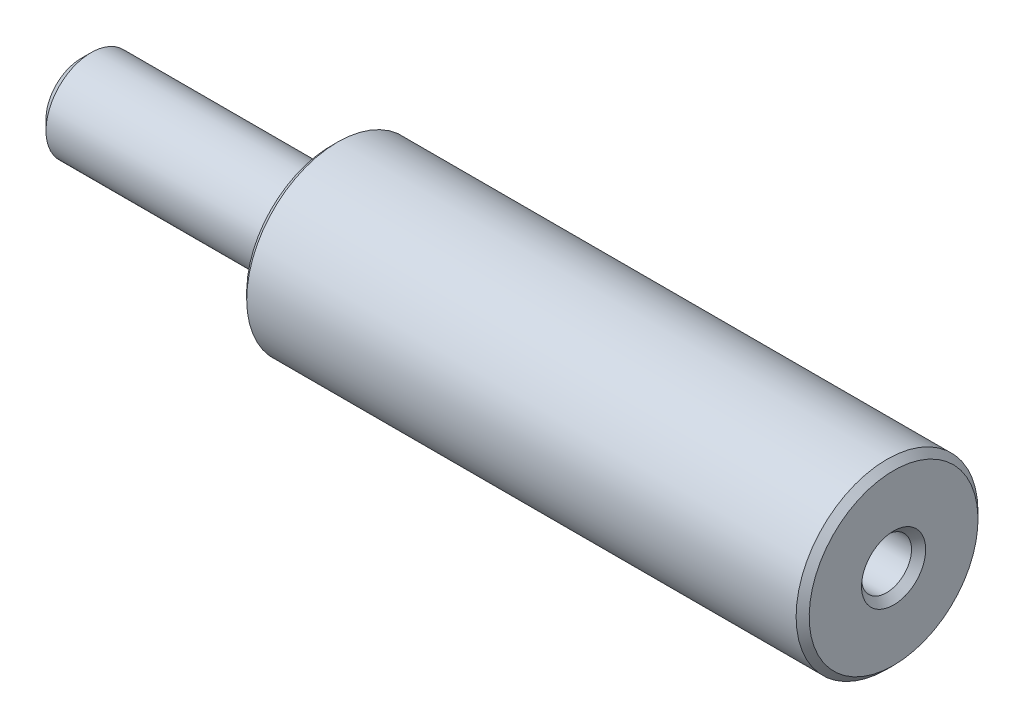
from build123d import *


with BuildPart() as part:
    # Sketch1 → Revolve1 (revolve)
    with BuildSketch(Plane(origin=(0, 0, 0), x_dir=(-1, 0, 0), z_dir=(0, 0, -1)), mode=Mode.PRIVATE) as revolve1_sk:
        with BuildLine():
            Line((-26.601714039, 2), (-25.11627907, 0))
            Line((-25.11627907, 0), (20, 0))
            Line((20, 0), (20, 2.810523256))
            Line((20, 2.810523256), (19.197325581, 3.613197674))
            Line((19.197325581, 3.613197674), (0.313953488, 3.613197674))
            ThreePointArc((0.313953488, 3.613197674), (0.091954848, 3.705152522), (0, 3.927151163))
            Line((0, 3.927151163), (0, 6.752732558))
            Line((0, 6.752732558), (-0.523255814, 7.275988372))
            Line((-0.523255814, 7.275988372), (-44.476744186, 7.275988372))
            Line((-44.476744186, 7.275988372), (-45, 6.752732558))
            Line((-45, 6.752732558), (-45, 2.566686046))
            Line((-45, 2.566686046), (-44.433313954, 2))
            Line((-44.433313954, 2), (-26.601714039, 2))
        make_face()
    revolve(revolve1_sk.sketch.rotate(Axis((45, 0, 0), (-1, 0, 0)), 180), axis=Axis((45, 0, 0), (-1, 0, 0)))


solid = part.part
